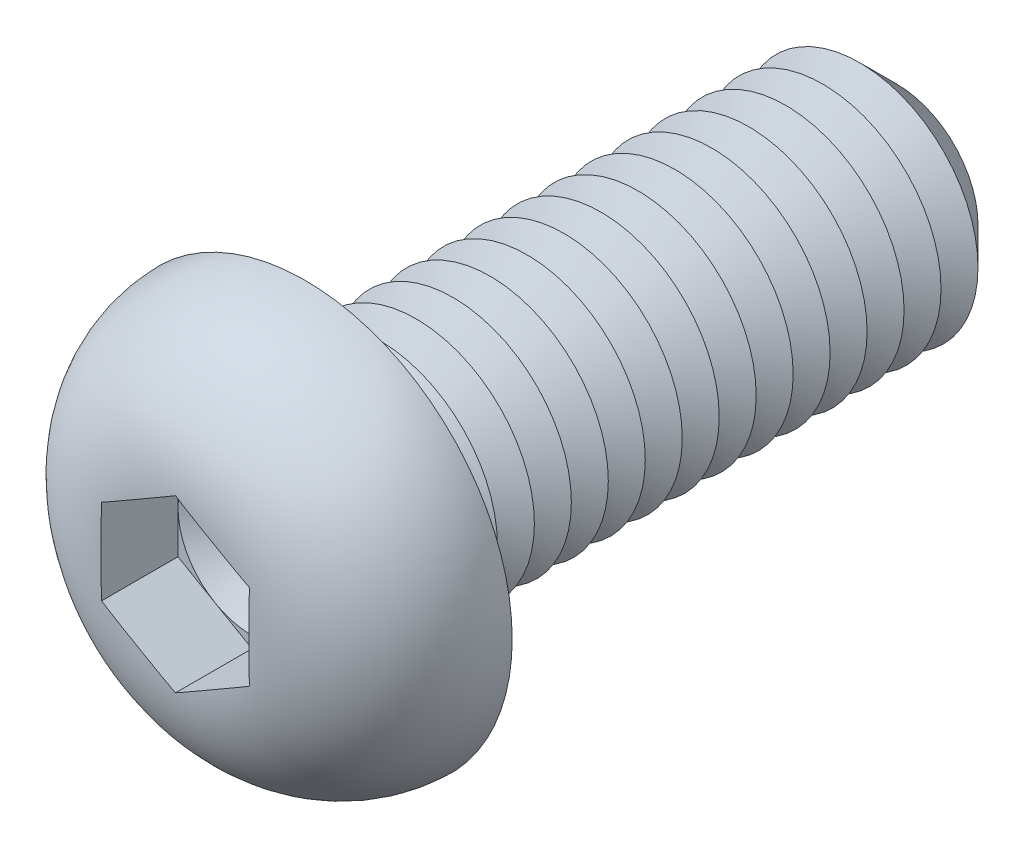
from build123d import *

# Parameters (mm, degrees)
CUT_EXTRUDE1_DEPTH  = 2.6
SKETCH4_R           = 4
BOSS_EXTRUDE1_DEPTH = 20
CHAMFER1_SIZE       = 1.25
LPATTERN1_COUNT     = 14
LPATTERN1_PITCH     = 1.25
FILLET2_R           = 0.5


with BuildPart() as part:
    # Sketch2 → Revolve1 (revolve)
    with BuildSketch(Plane(origin=(0, 0, 0), x_dir=(0, 0, -1), z_dir=(1, 0, 0)), mode=Mode.PRIVATE) as revolve1_sk:
        with BuildLine():
            Line((0, 0), (-4.4, 0))
            Line((-4.4, 0), (-4.4, 2.501111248))
            ThreePointArc((-4.4, 2.501111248), (-3.117141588, 5.647537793), (0, 7))
            Line((0, 7), (0, 0))
        make_face()
    revolve(revolve1_sk.sketch.rotate(Axis((0, 0, 47.934239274), (0, 0, -1)), 90), axis=Axis((0, 0, 47.934239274), (0, 0, -1)))

    # Sketch3 → Cut-Extrude1 (cut)
    with BuildSketch(Plane.XY.offset(4.4)):
        Polygon((0, 2.886751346), (-2.5, 1.443375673), (-2.5, -1.443375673), (0, -2.886751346), (2.5, -1.443375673), (2.5, 1.443375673), align=None)
    extrude(amount=-CUT_EXTRUDE1_DEPTH, mode=Mode.SUBTRACT)

    # Sketch4 → Boss-Extrude1 (add)
    with BuildSketch(Plane(origin=(0, 0, 0), x_dir=(-1, 0, 0), z_dir=(0, 0, -1))):
        with Locations(Location((0, 0, 0), (0, 0, 180))):
            Circle(SKETCH4_R)
    extrude(amount=BOSS_EXTRUDE1_DEPTH)

    # Chamfer1
    chamfer1_edges = [part.edges().sort_by_distance(p)[0] for p in [
        (-4, 0, -20),
    ]]
    chamfer(chamfer1_edges, length=CHAMFER1_SIZE)

    # Sketch5 → Cut-Revolve1 (revolve, cut)
    with BuildSketch(Plane(origin=(0, 0, 0), x_dir=(0, 0, -1), z_dir=(1, 0, 0)), mode=Mode.PRIVATE) as cut_revolve1_sk:
        Polygon((1.25, 4), (2.5, 4), (1.875, 2.917468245), align=None)
    cut_revolve1 = revolve(cut_revolve1_sk.sketch.rotate(Axis((0, 0, 47.934239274), (0, 0, -1)), 90), axis=Axis((0, 0, 47.934239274), (0, 0, -1)), mode=Mode.SUBTRACT)

    # LPattern1: Cut-Revolve1 ×14
    with Locations(*[(0, 0, -i * LPATTERN1_PITCH) for i in range(1, LPATTERN1_COUNT)]):
        add(cut_revolve1, mode=Mode.SUBTRACT)

    # Fillet2
    fillet2_edges = [part.edges().sort_by_distance(p)[0] for p in [
        (-4, 0, 0),
    ]]
    fillet(fillet2_edges, radius=FILLET2_R)

    # Cut-Extrude2 cone 1 section (on through the dimple's axis) → Cut-Extrude2 (revolve, cut)
    with BuildSketch(Plane(origin=(0, 0, 1.8), x_dir=(0, -1, 0), z_dir=(1, 0, 0))):
        Polygon((0, 0), (2.5, 0), (0, 1.443375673), align=None)
    revolve(axis=Axis((0, 0, 1.8), (0, 0, -1)), mode=Mode.SUBTRACT)


solid = part.part
